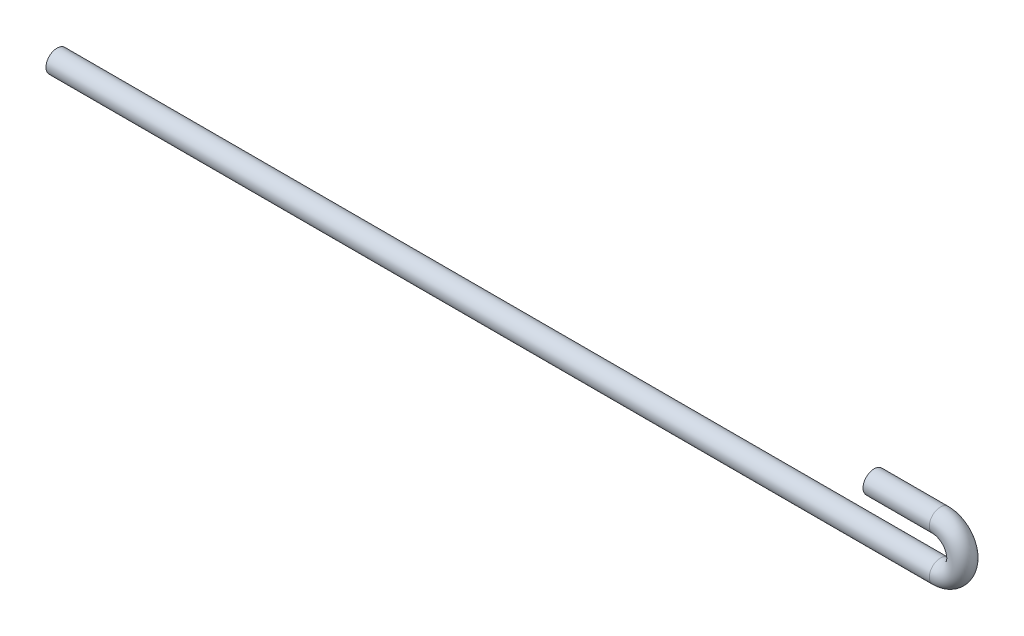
from build123d import *

# Parameters (mm, degrees)
ESQUISSE3_R = 0.25


with BuildPart() as part:
    # Balayage1: sweep along a path in Esquisse2
    with BuildLine(Plane.XY) as balayage1_path:
        Line((0, 0), (20, 0))
        ThreePointArc((20, 0), (20.5, 0.5), (20, 1))
        Line((20, 1), (18.5, 1))
    # Esquisse3 → Balayage1 (sweep)
    with BuildSketch(Plane(origin=(0, 0, 0), x_dir=(0, 0, -1), z_dir=(1, 0, 0))):
        Circle(ESQUISSE3_R)
    sweep(path=balayage1_path.line)


solid = part.part
